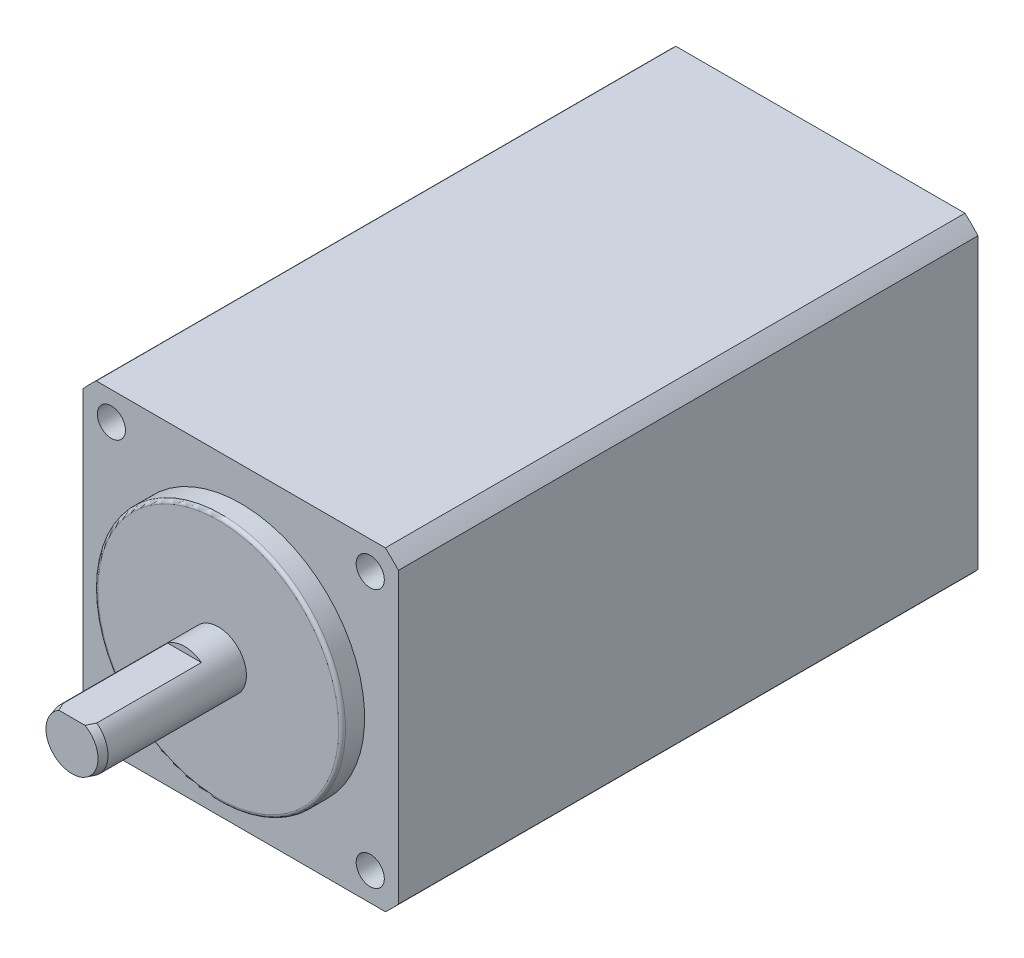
ISO-10303-21;
HEADER;
FILE_DESCRIPTION(('STEP AP214'),'2;1');
FILE_NAME('part.step','',(''),(''),'','','');
FILE_SCHEMA(('AUTOMOTIVE_DESIGN { 1 0 10303 214 1 1 1 1 }'));
ENDSEC;
DATA;
#1=APPLICATION_CONTEXT('core data for automotive mechanical design processes');
#2=APPLICATION_PROTOCOL_DEFINITION('international standard','automotive_design',2000,#1);
#3=PRODUCT_CONTEXT('',#1,'mechanical');
#4=PRODUCT('Part','Part','',(#3));
#5=PRODUCT_RELATED_PRODUCT_CATEGORY('part','',(#4));
#6=PRODUCT_DEFINITION_FORMATION('','',#4);
#7=PRODUCT_DEFINITION_CONTEXT('part definition',#1,'design');
#8=PRODUCT_DEFINITION('design','',#6,#7);
#9=PRODUCT_DEFINITION_SHAPE('','',#8);
#10=(LENGTH_UNIT() NAMED_UNIT(*) SI_UNIT(.MILLI.,.METRE.));
#11=(NAMED_UNIT(*) PLANE_ANGLE_UNIT() SI_UNIT($,.RADIAN.));
#12=(NAMED_UNIT(*) SI_UNIT($,.STERADIAN.) SOLID_ANGLE_UNIT());
#13=UNCERTAINTY_MEASURE_WITH_UNIT(LENGTH_MEASURE(1.E-05),#10,'distance_accuracy_value','');
#14=(GEOMETRIC_REPRESENTATION_CONTEXT(3) GLOBAL_UNCERTAINTY_ASSIGNED_CONTEXT((#13)) GLOBAL_UNIT_ASSIGNED_CONTEXT((#10,
#11,#12)) REPRESENTATION_CONTEXT('',''));
#15=CARTESIAN_POINT('',(0.,0.,0.));
#16=DIRECTION('',(0.,0.,1.));
#17=DIRECTION('',(1.,0.,0.));
#18=AXIS2_PLACEMENT_3D('',#15,#16,#17);
#19=CARTESIAN_POINT('',(-14.,0.,-51.5));
#20=DIRECTION('',(1.,0.,0.));
#21=DIRECTION('',(0.,0.,-1.));
#22=AXIS2_PLACEMENT_3D('',#19,#20,#21);
#23=PLANE('',#22);
#24=DIRECTION('',(0.,1.,0.));
#25=VECTOR('',#24,1.);
#26=CARTESIAN_POINT('',(-14.,0.,0.));
#27=LINE('',#26,#25);
#28=CARTESIAN_POINT('',(-14.,-12.8452325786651,0.));
#29=VERTEX_POINT('',#28);
#30=CARTESIAN_POINT('',(-14.,12.8452325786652,0.));
#31=VERTEX_POINT('',#30);
#32=EDGE_CURVE('E162',#29,#31,#27,.T.);
#33=ORIENTED_EDGE('',*,*,#32,.T.);
#34=DIRECTION('',(0.,0.,1.));
#35=VECTOR('',#34,1.);
#36=CARTESIAN_POINT('',(-14.,12.8452325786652,-51.5));
#37=LINE('',#36,#35);
#38=CARTESIAN_POINT('',(-14.,12.8452325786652,-51.5));
#39=VERTEX_POINT('',#38);
#40=EDGE_CURVE('E12',#39,#31,#37,.T.);
#41=ORIENTED_EDGE('',*,*,#40,.F.);
#42=DIRECTION('',(0.,1.,0.));
#43=VECTOR('',#42,1.);
#44=CARTESIAN_POINT('',(-14.,0.,-51.5));
#45=LINE('',#44,#43);
#46=CARTESIAN_POINT('',(-14.,-12.8452325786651,-51.5));
#47=VERTEX_POINT('',#46);
#48=EDGE_CURVE('E235',#47,#39,#45,.T.);
#49=ORIENTED_EDGE('',*,*,#48,.F.);
#50=DIRECTION('',(0.,0.,1.));
#51=VECTOR('',#50,1.);
#52=CARTESIAN_POINT('',(-14.,-12.8452325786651,-51.5));
#53=LINE('',#52,#51);
#54=EDGE_CURVE('E199',#47,#29,#53,.T.);
#55=ORIENTED_EDGE('',*,*,#54,.T.);
#56=EDGE_LOOP('',(#33,#41,#49,#55));
#57=FACE_BOUND('',#56,.T.);
#58=ADVANCED_FACE('F49',(#57),#23,.F.);
#59=CARTESIAN_POINT('',(0.,0.,-51.5));
#60=DIRECTION('',(0.,0.,1.));
#61=DIRECTION('',(1.,0.,0.));
#62=AXIS2_PLACEMENT_3D('',#59,#60,#61);
#63=CYLINDRICAL_SURFACE('',#62,19.);
#64=CARTESIAN_POINT('',(0.,0.,0.));
#65=DIRECTION('',(0.,0.,-1.));
#66=DIRECTION('',(-1.,0.,0.));
#67=AXIS2_PLACEMENT_3D('',#64,#65,#66);
#68=CIRCLE('',#67,19.);
#69=CARTESIAN_POINT('',(-12.8452325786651,14.,0.));
#70=VERTEX_POINT('',#69);
#71=EDGE_CURVE('E165',#31,#70,#68,.T.);
#72=ORIENTED_EDGE('',*,*,#71,.T.);
#73=DIRECTION('',(0.,0.,1.));
#74=VECTOR('',#73,1.);
#75=CARTESIAN_POINT('',(-12.8452325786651,14.,-51.5));
#76=LINE('',#75,#74);
#77=CARTESIAN_POINT('',(-12.8452325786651,14.,-51.5));
#78=VERTEX_POINT('',#77);
#79=EDGE_CURVE('E58',#78,#70,#76,.T.);
#80=ORIENTED_EDGE('',*,*,#79,.F.);
#81=CARTESIAN_POINT('',(0.,0.,-51.5));
#82=DIRECTION('',(0.,0.,-1.));
#83=DIRECTION('',(-1.,0.,0.));
#84=AXIS2_PLACEMENT_3D('',#81,#82,#83);
#85=CIRCLE('',#84,19.);
#86=EDGE_CURVE('E239',#39,#78,#85,.T.);
#87=ORIENTED_EDGE('',*,*,#86,.F.);
#88=ORIENTED_EDGE('',*,*,#40,.T.);
#89=EDGE_LOOP('',(#72,#80,#87,#88));
#90=FACE_BOUND('',#89,.T.);
#91=ADVANCED_FACE('F257',(#90),#63,.T.);
#92=CARTESIAN_POINT('',(0.,14.,-51.5));
#93=DIRECTION('',(0.,-1.,0.));
#94=DIRECTION('',(0.,0.,-1.));
#95=AXIS2_PLACEMENT_3D('',#92,#93,#94);
#96=PLANE('',#95);
#97=DIRECTION('',(1.,0.,0.));
#98=VECTOR('',#97,1.);
#99=CARTESIAN_POINT('',(0.,14.,0.));
#100=LINE('',#99,#98);
#101=CARTESIAN_POINT('',(12.8452325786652,14.,0.));
#102=VERTEX_POINT('',#101);
#103=EDGE_CURVE('E188',#70,#102,#100,.T.);
#104=ORIENTED_EDGE('',*,*,#103,.T.);
#105=DIRECTION('',(0.,0.,1.));
#106=VECTOR('',#105,1.);
#107=CARTESIAN_POINT('',(12.8452325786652,14.,-51.5));
#108=LINE('',#107,#106);
#109=CARTESIAN_POINT('',(12.8452325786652,14.,-51.5));
#110=VERTEX_POINT('',#109);
#111=EDGE_CURVE('E211',#110,#102,#108,.T.);
#112=ORIENTED_EDGE('',*,*,#111,.F.);
#113=DIRECTION('',(1.,0.,0.));
#114=VECTOR('',#113,1.);
#115=CARTESIAN_POINT('',(0.,14.,-51.5));
#116=LINE('',#115,#114);
#117=EDGE_CURVE('E221',#78,#110,#116,.T.);
#118=ORIENTED_EDGE('',*,*,#117,.F.);
#119=ORIENTED_EDGE('',*,*,#79,.T.);
#120=EDGE_LOOP('',(#104,#112,#118,#119));
#121=FACE_BOUND('',#120,.T.);
#122=ADVANCED_FACE('F219',(#121),#96,.F.);
#123=CARTESIAN_POINT('',(14.,12.8452325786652,0.));
#124=VERTEX_POINT('',#123);
#125=EDGE_CURVE('E190',#102,#124,#68,.T.);
#126=ORIENTED_EDGE('',*,*,#125,.T.);
#127=DIRECTION('',(0.,0.,1.));
#128=VECTOR('',#127,1.);
#129=CARTESIAN_POINT('',(14.,12.8452325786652,-51.5));
#130=LINE('',#129,#128);
#131=CARTESIAN_POINT('',(14.,12.8452325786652,-51.5));
#132=VERTEX_POINT('',#131);
#133=EDGE_CURVE('E209',#132,#124,#130,.T.);
#134=ORIENTED_EDGE('',*,*,#133,.F.);
#135=EDGE_CURVE('E244',#110,#132,#85,.T.);
#136=ORIENTED_EDGE('',*,*,#135,.F.);
#137=ORIENTED_EDGE('',*,*,#111,.T.);
#138=EDGE_LOOP('',(#126,#134,#136,#137));
#139=FACE_BOUND('',#138,.T.);
#140=ADVANCED_FACE('F260',(#139),#63,.T.);
#141=CARTESIAN_POINT('',(14.,0.,-51.5));
#142=DIRECTION('',(1.,0.,0.));
#143=DIRECTION('',(0.,0.,-1.));
#144=AXIS2_PLACEMENT_3D('',#141,#142,#143);
#145=PLANE('',#144);
#146=DIRECTION('',(0.,1.,0.));
#147=VECTOR('',#146,1.);
#148=CARTESIAN_POINT('',(14.,0.,0.));
#149=LINE('',#148,#147);
#150=CARTESIAN_POINT('',(14.,-12.8452325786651,0.));
#151=VERTEX_POINT('',#150);
#152=EDGE_CURVE('E192',#151,#124,#149,.T.);
#153=ORIENTED_EDGE('',*,*,#152,.F.);
#154=DIRECTION('',(0.,0.,1.));
#155=VECTOR('',#154,1.);
#156=CARTESIAN_POINT('',(14.,-12.8452325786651,-51.5));
#157=LINE('',#156,#155);
#158=CARTESIAN_POINT('',(14.,-12.8452325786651,-51.5));
#159=VERTEX_POINT('',#158);
#160=EDGE_CURVE('E207',#159,#151,#157,.T.);
#161=ORIENTED_EDGE('',*,*,#160,.F.);
#162=DIRECTION('',(0.,1.,0.));
#163=VECTOR('',#162,1.);
#164=CARTESIAN_POINT('',(14.,0.,-51.5));
#165=LINE('',#164,#163);
#166=EDGE_CURVE('E183',#159,#132,#165,.T.);
#167=ORIENTED_EDGE('',*,*,#166,.T.);
#168=ORIENTED_EDGE('',*,*,#133,.T.);
#169=EDGE_LOOP('',(#153,#161,#167,#168));
#170=FACE_BOUND('',#169,.T.);
#171=ADVANCED_FACE('F268',(#170),#145,.T.);
#172=CARTESIAN_POINT('',(12.8452325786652,-14.,0.));
#173=VERTEX_POINT('',#172);
#174=EDGE_CURVE('E195',#151,#173,#68,.T.);
#175=ORIENTED_EDGE('',*,*,#174,.T.);
#176=DIRECTION('',(0.,0.,1.));
#177=VECTOR('',#176,1.);
#178=CARTESIAN_POINT('',(12.8452325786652,-14.,-51.5));
#179=LINE('',#178,#177);
#180=CARTESIAN_POINT('',(12.8452325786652,-14.,-51.5));
#181=VERTEX_POINT('',#180);
#182=EDGE_CURVE('E205',#181,#173,#179,.T.);
#183=ORIENTED_EDGE('',*,*,#182,.F.);
#184=EDGE_CURVE('E180',#159,#181,#85,.T.);
#185=ORIENTED_EDGE('',*,*,#184,.F.);
#186=ORIENTED_EDGE('',*,*,#160,.T.);
#187=EDGE_LOOP('',(#175,#183,#185,#186));
#188=FACE_BOUND('',#187,.T.);
#189=ADVANCED_FACE('F269',(#188),#63,.T.);
#190=CARTESIAN_POINT('',(0.,-14.,-51.5));
#191=DIRECTION('',(0.,-1.,0.));
#192=DIRECTION('',(0.,0.,-1.));
#193=AXIS2_PLACEMENT_3D('',#190,#191,#192);
#194=PLANE('',#193);
#195=DIRECTION('',(0.,0.,-1.));
#196=VECTOR('',#195,1.);
#197=CARTESIAN_POINT('',(-7.6,-14.,-51.5));
#198=LINE('',#197,#196);
#199=CARTESIAN_POINT('',(-7.6,-14.,-42.));
#200=VERTEX_POINT('',#199);
#201=CARTESIAN_POINT('',(-7.6,-14.,-51.5));
#202=VERTEX_POINT('',#201);
#203=EDGE_CURVE('E52',#200,#202,#198,.T.);
#204=ORIENTED_EDGE('',*,*,#203,.F.);
#205=DIRECTION('',(-1.,0.,0.));
#206=VECTOR('',#205,1.);
#207=CARTESIAN_POINT('',(-7.6,-14.,-42.));
#208=LINE('',#207,#206);
#209=CARTESIAN_POINT('',(7.6,-14.,-42.));
#210=VERTEX_POINT('',#209);
#211=EDGE_CURVE('E159',#210,#200,#208,.T.);
#212=ORIENTED_EDGE('',*,*,#211,.F.);
#213=DIRECTION('',(0.,0.,1.));
#214=VECTOR('',#213,1.);
#215=CARTESIAN_POINT('',(7.6,-14.,-51.5));
#216=LINE('',#215,#214);
#217=CARTESIAN_POINT('',(7.6,-14.,-51.5));
#218=VERTEX_POINT('',#217);
#219=EDGE_CURVE('E71',#218,#210,#216,.T.);
#220=ORIENTED_EDGE('',*,*,#219,.F.);
#221=DIRECTION('',(1.,0.,0.));
#222=VECTOR('',#221,1.);
#223=CARTESIAN_POINT('',(0.,-14.,-51.5));
#224=LINE('',#223,#222);
#225=EDGE_CURVE('E176',#218,#181,#224,.T.);
#226=ORIENTED_EDGE('',*,*,#225,.T.);
#227=ORIENTED_EDGE('',*,*,#182,.T.);
#228=DIRECTION('',(1.,0.,0.));
#229=VECTOR('',#228,1.);
#230=CARTESIAN_POINT('',(0.,-14.,0.));
#231=LINE('',#230,#229);
#232=CARTESIAN_POINT('',(-12.8452325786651,-14.,0.));
#233=VERTEX_POINT('',#232);
#234=EDGE_CURVE('E196',#233,#173,#231,.T.);
#235=ORIENTED_EDGE('',*,*,#234,.F.);
#236=DIRECTION('',(0.,0.,1.));
#237=VECTOR('',#236,1.);
#238=CARTESIAN_POINT('',(-12.8452325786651,-14.,-51.5));
#239=LINE('',#238,#237);
#240=CARTESIAN_POINT('',(-12.8452325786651,-14.,-51.5));
#241=VERTEX_POINT('',#240);
#242=EDGE_CURVE('E202',#241,#233,#239,.T.);
#243=ORIENTED_EDGE('',*,*,#242,.F.);
#244=EDGE_CURVE('E179',#241,#202,#224,.T.);
#245=ORIENTED_EDGE('',*,*,#244,.T.);
#246=EDGE_LOOP('',(#204,#212,#220,#226,#227,#235,#243,#245));
#247=FACE_BOUND('',#246,.T.);
#248=ADVANCED_FACE('F253',(#247),#194,.T.);
#249=EDGE_CURVE('E189',#233,#29,#68,.T.);
#250=ORIENTED_EDGE('',*,*,#249,.T.);
#251=ORIENTED_EDGE('',*,*,#54,.F.);
#252=EDGE_CURVE('E203',#241,#47,#85,.T.);
#253=ORIENTED_EDGE('',*,*,#252,.F.);
#254=ORIENTED_EDGE('',*,*,#242,.T.);
#255=EDGE_LOOP('',(#250,#251,#253,#254));
#256=FACE_BOUND('',#255,.T.);
#257=ADVANCED_FACE('F255',(#256),#63,.T.);
#258=CARTESIAN_POINT('',(0.,0.,-51.5));
#259=DIRECTION('',(0.,0.,-1.));
#260=DIRECTION('',(-1.,0.,0.));
#261=AXIS2_PLACEMENT_3D('',#258,#259,#260);
#262=PLANE('',#261);
#263=ORIENTED_EDGE('',*,*,#48,.T.);
#264=ORIENTED_EDGE('',*,*,#86,.T.);
#265=ORIENTED_EDGE('',*,*,#117,.T.);
#266=ORIENTED_EDGE('',*,*,#135,.T.);
#267=ORIENTED_EDGE('',*,*,#166,.F.);
#268=ORIENTED_EDGE('',*,*,#184,.T.);
#269=ORIENTED_EDGE('',*,*,#225,.F.);
#270=DIRECTION('',(0.,1.,0.));
#271=VECTOR('',#270,1.);
#272=CARTESIAN_POINT('',(7.6,-19.,-51.5));
#273=LINE('',#272,#271);
#274=CARTESIAN_POINT('',(7.6,-19.,-51.5));
#275=VERTEX_POINT('',#274);
#276=EDGE_CURVE('E146',#275,#218,#273,.T.);
#277=ORIENTED_EDGE('',*,*,#276,.F.);
#278=DIRECTION('',(1.,0.,0.));
#279=VECTOR('',#278,1.);
#280=CARTESIAN_POINT('',(-7.6,-19.,-51.5));
#281=LINE('',#280,#279);
#282=CARTESIAN_POINT('',(-7.6,-19.,-51.5));
#283=VERTEX_POINT('',#282);
#284=EDGE_CURVE('E138',#283,#275,#281,.T.);
#285=ORIENTED_EDGE('',*,*,#284,.F.);
#286=DIRECTION('',(0.,1.,0.));
#287=VECTOR('',#286,1.);
#288=CARTESIAN_POINT('',(-7.6,-19.,-51.5));
#289=LINE('',#288,#287);
#290=EDGE_CURVE('E144',#283,#202,#289,.T.);
#291=ORIENTED_EDGE('',*,*,#290,.T.);
#292=ORIENTED_EDGE('',*,*,#244,.F.);
#293=ORIENTED_EDGE('',*,*,#252,.T.);
#294=EDGE_LOOP('',(#263,#264,#265,#266,#267,#268,#269,#277,#285,#291,#292,#293));
#295=FACE_BOUND('',#294,.T.);
#296=ADVANCED_FACE('F141',(#295),#262,.T.);
#297=CARTESIAN_POINT('',(0.,0.,0.));
#298=DIRECTION('',(0.,0.,-1.));
#299=DIRECTION('',(-1.,0.,0.));
#300=AXIS2_PLACEMENT_3D('',#297,#298,#299);
#301=PLANE('',#300);
#302=CARTESIAN_POINT('',(11.5,-11.5,0.));
#303=DIRECTION('',(0.,0.,1.));
#304=DIRECTION('',(1.,0.,0.));
#305=AXIS2_PLACEMENT_3D('',#302,#303,#304);
#306=CIRCLE('',#305,1.25);
#307=CARTESIAN_POINT('',(12.75,-11.5,0.));
#308=VERTEX_POINT('',#307);
#309=EDGE_CURVE('E314',#308,#308,#306,.T.);
#310=ORIENTED_EDGE('',*,*,#309,.F.);
#311=EDGE_LOOP('',(#310));
#312=FACE_BOUND('',#311,.T.);
#313=CARTESIAN_POINT('',(-11.5,-11.5,0.));
#314=DIRECTION('',(0.,0.,1.));
#315=DIRECTION('',(1.,0.,0.));
#316=AXIS2_PLACEMENT_3D('',#313,#314,#315);
#317=CIRCLE('',#316,1.25);
#318=CARTESIAN_POINT('',(-10.25,-11.5,0.));
#319=VERTEX_POINT('',#318);
#320=EDGE_CURVE('E318',#319,#319,#317,.T.);
#321=ORIENTED_EDGE('',*,*,#320,.F.);
#322=EDGE_LOOP('',(#321));
#323=FACE_BOUND('',#322,.T.);
#324=CARTESIAN_POINT('',(11.5,11.5,0.));
#325=DIRECTION('',(0.,0.,1.));
#326=DIRECTION('',(1.,0.,0.));
#327=AXIS2_PLACEMENT_3D('',#324,#325,#326);
#328=CIRCLE('',#327,1.25);
#329=CARTESIAN_POINT('',(12.75,11.5,0.));
#330=VERTEX_POINT('',#329);
#331=EDGE_CURVE('E322',#330,#330,#328,.T.);
#332=ORIENTED_EDGE('',*,*,#331,.F.);
#333=EDGE_LOOP('',(#332));
#334=FACE_BOUND('',#333,.T.);
#335=CARTESIAN_POINT('',(-11.5,11.5,0.));
#336=DIRECTION('',(0.,0.,1.));
#337=DIRECTION('',(1.,0.,0.));
#338=AXIS2_PLACEMENT_3D('',#335,#336,#337);
#339=CIRCLE('',#338,1.25);
#340=CARTESIAN_POINT('',(-10.25,11.5,0.));
#341=VERTEX_POINT('',#340);
#342=EDGE_CURVE('E325',#341,#341,#339,.T.);
#343=ORIENTED_EDGE('',*,*,#342,.F.);
#344=EDGE_LOOP('',(#343));
#345=FACE_BOUND('',#344,.T.);
#346=ORIENTED_EDGE('',*,*,#32,.F.);
#347=ORIENTED_EDGE('',*,*,#249,.F.);
#348=ORIENTED_EDGE('',*,*,#234,.T.);
#349=ORIENTED_EDGE('',*,*,#174,.F.);
#350=ORIENTED_EDGE('',*,*,#152,.T.);
#351=ORIENTED_EDGE('',*,*,#125,.F.);
#352=ORIENTED_EDGE('',*,*,#103,.F.);
#353=ORIENTED_EDGE('',*,*,#71,.F.);
#354=EDGE_LOOP('',(#346,#347,#348,#349,#350,#351,#352,#353));
#355=FACE_BOUND('',#354,.T.);
#356=ADVANCED_FACE('F226',(#312,#323,#334,#345,#355),#301,.F.);
#357=CARTESIAN_POINT('',(-7.6,-19.,-51.5));
#358=DIRECTION('',(1.,0.,0.));
#359=DIRECTION('',(0.,0.,-1.));
#360=AXIS2_PLACEMENT_3D('',#357,#358,#359);
#361=PLANE('',#360);
#362=ORIENTED_EDGE('',*,*,#203,.T.);
#363=ORIENTED_EDGE('',*,*,#290,.F.);
#364=DIRECTION('',(0.,0.,-1.));
#365=VECTOR('',#364,1.);
#366=CARTESIAN_POINT('',(-7.6,-19.,-51.5));
#367=LINE('',#366,#365);
#368=CARTESIAN_POINT('',(-7.6,-19.,-42.));
#369=VERTEX_POINT('',#368);
#370=EDGE_CURVE('E150',#369,#283,#367,.T.);
#371=ORIENTED_EDGE('',*,*,#370,.F.);
#372=DIRECTION('',(0.,1.,0.));
#373=VECTOR('',#372,1.);
#374=CARTESIAN_POINT('',(-7.6,-19.,-42.));
#375=LINE('',#374,#373);
#376=EDGE_CURVE('E289',#369,#200,#375,.T.);
#377=ORIENTED_EDGE('',*,*,#376,.T.);
#378=EDGE_LOOP('',(#362,#363,#371,#377));
#379=FACE_BOUND('',#378,.T.);
#380=ADVANCED_FACE('F161',(#379),#361,.F.);
#381=CARTESIAN_POINT('',(7.6,-19.,-51.5));
#382=DIRECTION('',(-1.,0.,0.));
#383=DIRECTION('',(0.,0.,1.));
#384=AXIS2_PLACEMENT_3D('',#381,#382,#383);
#385=PLANE('',#384);
#386=ORIENTED_EDGE('',*,*,#219,.T.);
#387=DIRECTION('',(0.,1.,0.));
#388=VECTOR('',#387,1.);
#389=CARTESIAN_POINT('',(7.6,-19.,-42.));
#390=LINE('',#389,#388);
#391=CARTESIAN_POINT('',(7.6,-19.,-42.));
#392=VERTEX_POINT('',#391);
#393=EDGE_CURVE('E167',#392,#210,#390,.T.);
#394=ORIENTED_EDGE('',*,*,#393,.F.);
#395=DIRECTION('',(0.,0.,1.));
#396=VECTOR('',#395,1.);
#397=CARTESIAN_POINT('',(7.6,-19.,-51.5));
#398=LINE('',#397,#396);
#399=EDGE_CURVE('E149',#275,#392,#398,.T.);
#400=ORIENTED_EDGE('',*,*,#399,.F.);
#401=ORIENTED_EDGE('',*,*,#276,.T.);
#402=EDGE_LOOP('',(#386,#394,#400,#401));
#403=FACE_BOUND('',#402,.T.);
#404=ADVANCED_FACE('F285',(#403),#385,.F.);
#405=CARTESIAN_POINT('',(-7.6,-19.,-42.));
#406=DIRECTION('',(0.,0.,-1.));
#407=DIRECTION('',(-1.,0.,0.));
#408=AXIS2_PLACEMENT_3D('',#405,#406,#407);
#409=PLANE('',#408);
#410=ORIENTED_EDGE('',*,*,#211,.T.);
#411=ORIENTED_EDGE('',*,*,#376,.F.);
#412=DIRECTION('',(-1.,0.,0.));
#413=VECTOR('',#412,1.);
#414=CARTESIAN_POINT('',(-7.6,-19.,-42.));
#415=LINE('',#414,#413);
#416=EDGE_CURVE('E155',#392,#369,#415,.T.);
#417=ORIENTED_EDGE('',*,*,#416,.F.);
#418=ORIENTED_EDGE('',*,*,#393,.T.);
#419=EDGE_LOOP('',(#410,#411,#417,#418));
#420=FACE_BOUND('',#419,.T.);
#421=ADVANCED_FACE('F294',(#420),#409,.F.);
#422=CARTESIAN_POINT('',(0.,-19.,0.));
#423=DIRECTION('',(0.,1.,0.));
#424=DIRECTION('',(0.,0.,1.));
#425=AXIS2_PLACEMENT_3D('',#422,#423,#424);
#426=PLANE('',#425);
#427=ORIENTED_EDGE('',*,*,#370,.T.);
#428=ORIENTED_EDGE('',*,*,#284,.T.);
#429=ORIENTED_EDGE('',*,*,#399,.T.);
#430=ORIENTED_EDGE('',*,*,#416,.T.);
#431=EDGE_LOOP('',(#427,#428,#429,#430));
#432=FACE_BOUND('',#431,.T.);
#433=ADVANCED_FACE('F153',(#432),#426,.F.);
#434=CARTESIAN_POINT('',(-11.5,11.5,-4.5));
#435=DIRECTION('',(0.,0.,1.));
#436=DIRECTION('',(1.,0.,0.));
#437=AXIS2_PLACEMENT_3D('',#434,#435,#436);
#438=CYLINDRICAL_SURFACE('',#437,1.25);
#439=CARTESIAN_POINT('',(-11.5,11.5,-4.5));
#440=DIRECTION('',(0.,0.,1.));
#441=DIRECTION('',(1.,0.,0.));
#442=AXIS2_PLACEMENT_3D('',#439,#440,#441);
#443=CIRCLE('',#442,1.25);
#444=CARTESIAN_POINT('',(-10.25,11.5,-4.5));
#445=VERTEX_POINT('',#444);
#446=EDGE_CURVE('E327',#445,#445,#443,.T.);
#447=ORIENTED_EDGE('',*,*,#446,.F.);
#448=EDGE_LOOP('',(#447));
#449=FACE_BOUND('',#448,.T.);
#450=ORIENTED_EDGE('',*,*,#342,.T.);
#451=EDGE_LOOP('',(#450));
#452=FACE_BOUND('',#451,.T.);
#453=ADVANCED_FACE('F301',(#449,#452),#438,.F.);
#454=CARTESIAN_POINT('',(-11.5,11.5,-4.5));
#455=DIRECTION('',(0.,0.,1.));
#456=DIRECTION('',(1.,0.,0.));
#457=AXIS2_PLACEMENT_3D('',#454,#455,#456);
#458=PLANE('',#457);
#459=ORIENTED_EDGE('',*,*,#446,.T.);
#460=EDGE_LOOP('',(#459));
#461=FACE_BOUND('',#460,.T.);
#462=ADVANCED_FACE('F371',(#461),#458,.T.);
#463=CARTESIAN_POINT('',(11.5,11.5,-4.5));
#464=DIRECTION('',(0.,0.,1.));
#465=DIRECTION('',(1.,0.,0.));
#466=AXIS2_PLACEMENT_3D('',#463,#464,#465);
#467=CYLINDRICAL_SURFACE('',#466,1.25);
#468=CARTESIAN_POINT('',(11.5,11.5,-4.5));
#469=DIRECTION('',(0.,0.,1.));
#470=DIRECTION('',(1.,0.,0.));
#471=AXIS2_PLACEMENT_3D('',#468,#469,#470);
#472=CIRCLE('',#471,1.25);
#473=CARTESIAN_POINT('',(12.75,11.5,-4.5));
#474=VERTEX_POINT('',#473);
#475=EDGE_CURVE('E328',#474,#474,#472,.T.);
#476=ORIENTED_EDGE('',*,*,#475,.F.);
#477=EDGE_LOOP('',(#476));
#478=FACE_BOUND('',#477,.T.);
#479=ORIENTED_EDGE('',*,*,#331,.T.);
#480=EDGE_LOOP('',(#479));
#481=FACE_BOUND('',#480,.T.);
#482=ADVANCED_FACE('F367',(#478,#481),#467,.F.);
#483=CARTESIAN_POINT('',(11.5,11.5,-4.5));
#484=DIRECTION('',(0.,0.,1.));
#485=DIRECTION('',(1.,0.,0.));
#486=AXIS2_PLACEMENT_3D('',#483,#484,#485);
#487=PLANE('',#486);
#488=ORIENTED_EDGE('',*,*,#475,.T.);
#489=EDGE_LOOP('',(#488));
#490=FACE_BOUND('',#489,.T.);
#491=ADVANCED_FACE('F363',(#490),#487,.T.);
#492=CARTESIAN_POINT('',(-11.5,-11.5,-4.5));
#493=DIRECTION('',(0.,0.,1.));
#494=DIRECTION('',(1.,0.,0.));
#495=AXIS2_PLACEMENT_3D('',#492,#493,#494);
#496=CYLINDRICAL_SURFACE('',#495,1.25);
#497=CARTESIAN_POINT('',(-11.5,-11.5,-4.5));
#498=DIRECTION('',(0.,0.,1.));
#499=DIRECTION('',(1.,0.,0.));
#500=AXIS2_PLACEMENT_3D('',#497,#498,#499);
#501=CIRCLE('',#500,1.25);
#502=CARTESIAN_POINT('',(-10.25,-11.5,-4.5));
#503=VERTEX_POINT('',#502);
#504=EDGE_CURVE('E335',#503,#503,#501,.T.);
#505=ORIENTED_EDGE('',*,*,#504,.F.);
#506=EDGE_LOOP('',(#505));
#507=FACE_BOUND('',#506,.T.);
#508=ORIENTED_EDGE('',*,*,#320,.T.);
#509=EDGE_LOOP('',(#508));
#510=FACE_BOUND('',#509,.T.);
#511=ADVANCED_FACE('F357',(#507,#510),#496,.F.);
#512=CARTESIAN_POINT('',(-11.5,-11.5,-4.5));
#513=DIRECTION('',(0.,0.,1.));
#514=DIRECTION('',(1.,0.,0.));
#515=AXIS2_PLACEMENT_3D('',#512,#513,#514);
#516=PLANE('',#515);
#517=ORIENTED_EDGE('',*,*,#504,.T.);
#518=EDGE_LOOP('',(#517));
#519=FACE_BOUND('',#518,.T.);
#520=ADVANCED_FACE('F350',(#519),#516,.T.);
#521=CARTESIAN_POINT('',(11.5,-11.5,-4.5));
#522=DIRECTION('',(0.,0.,1.));
#523=DIRECTION('',(1.,0.,0.));
#524=AXIS2_PLACEMENT_3D('',#521,#522,#523);
#525=CYLINDRICAL_SURFACE('',#524,1.25);
#526=CARTESIAN_POINT('',(11.5,-11.5,-4.5));
#527=DIRECTION('',(0.,0.,1.));
#528=DIRECTION('',(1.,0.,0.));
#529=AXIS2_PLACEMENT_3D('',#526,#527,#528);
#530=CIRCLE('',#529,1.25);
#531=CARTESIAN_POINT('',(12.75,-11.5,-4.5));
#532=VERTEX_POINT('',#531);
#533=EDGE_CURVE('E338',#532,#532,#530,.T.);
#534=ORIENTED_EDGE('',*,*,#533,.F.);
#535=EDGE_LOOP('',(#534));
#536=FACE_BOUND('',#535,.T.);
#537=ORIENTED_EDGE('',*,*,#309,.T.);
#538=EDGE_LOOP('',(#537));
#539=FACE_BOUND('',#538,.T.);
#540=ADVANCED_FACE('F347',(#536,#539),#525,.F.);
#541=CARTESIAN_POINT('',(11.5,-11.5,-4.5));
#542=DIRECTION('',(0.,0.,1.));
#543=DIRECTION('',(1.,0.,0.));
#544=AXIS2_PLACEMENT_3D('',#541,#542,#543);
#545=PLANE('',#544);
#546=ORIENTED_EDGE('',*,*,#533,.T.);
#547=EDGE_LOOP('',(#546));
#548=FACE_BOUND('',#547,.T.);
#549=ADVANCED_FACE('F345',(#548),#545,.T.);
#550=CLOSED_SHELL('',(#58,#91,#122,#140,#171,#189,#248,#257,#296,#356,#380,#404,#421,#433,#453,
#462,#482,#491,#511,#520,#540,#549));
#551=MANIFOLD_SOLID_BREP('B2',#550);
#552=CARTESIAN_POINT('',(0.,0.,15.));
#553=DIRECTION('',(0.,0.,-1.));
#554=DIRECTION('',(-1.,0.,0.));
#555=AXIS2_PLACEMENT_3D('',#552,#553,#554);
#556=CYLINDRICAL_SURFACE('',#555,2.5);
#557=DIRECTION('',(0.,0.,-1.));
#558=VECTOR('',#557,1.);
#559=CARTESIAN_POINT('',(1.5,2.,15.));
#560=LINE('',#559,#558);
#561=CARTESIAN_POINT('',(1.5,2.,5.));
#562=VERTEX_POINT('',#561);
#563=CARTESIAN_POINT('',(1.5,2.,14.3));
#564=VERTEX_POINT('',#563);
#565=EDGE_CURVE('E546',#562,#564,#560,.F.);
#566=ORIENTED_EDGE('',*,*,#565,.T.);
#567=CARTESIAN_POINT('',(0.,0.,14.3));
#568=DIRECTION('',(0.,0.,1.));
#569=DIRECTION('',(1.,0.,0.));
#570=AXIS2_PLACEMENT_3D('',#567,#568,#569);
#571=CIRCLE('',#570,2.5);
#572=CARTESIAN_POINT('',(-1.5,2.,14.3));
#573=VERTEX_POINT('',#572);
#574=EDGE_CURVE('E521',#564,#573,#571,.F.);
#575=ORIENTED_EDGE('',*,*,#574,.T.);
#576=DIRECTION('',(0.,0.,-1.));
#577=VECTOR('',#576,1.);
#578=CARTESIAN_POINT('',(-1.5,2.,15.));
#579=LINE('',#578,#577);
#580=CARTESIAN_POINT('',(-1.5,2.,5.));
#581=VERTEX_POINT('',#580);
#582=EDGE_CURVE('E539',#573,#581,#579,.T.);
#583=ORIENTED_EDGE('',*,*,#582,.T.);
#584=CARTESIAN_POINT('',(0.,0.,5.));
#585=DIRECTION('',(0.,0.,1.));
#586=DIRECTION('',(1.,0.,0.));
#587=AXIS2_PLACEMENT_3D('',#584,#585,#586);
#588=CIRCLE('',#587,2.5);
#589=EDGE_CURVE('E542',#562,#581,#588,.T.);
#590=ORIENTED_EDGE('',*,*,#589,.F.);
#591=EDGE_LOOP('',(#566,#575,#583,#590));
#592=FACE_BOUND('',#591,.T.);
#593=CARTESIAN_POINT('',(0.,0.,2.));
#594=DIRECTION('',(0.,0.,-1.));
#595=DIRECTION('',(-1.,0.,0.));
#596=AXIS2_PLACEMENT_3D('',#593,#594,#595);
#597=CIRCLE('',#596,2.5);
#598=CARTESIAN_POINT('',(-2.5,0.,2.));
#599=VERTEX_POINT('',#598);
#600=EDGE_CURVE('E561',#599,#599,#597,.T.);
#601=ORIENTED_EDGE('',*,*,#600,.F.);
#602=EDGE_LOOP('',(#601));
#603=FACE_BOUND('',#602,.T.);
#604=ADVANCED_FACE('F506',(#592,#603),#556,.T.);
#605=CARTESIAN_POINT('',(0.,0.,15.));
#606=DIRECTION('',(0.,0.,1.));
#607=DIRECTION('',(1.,0.,0.));
#608=AXIS2_PLACEMENT_3D('',#605,#606,#607);
#609=PLANE('',#608);
#610=DIRECTION('',(1.,0.,0.));
#611=VECTOR('',#610,1.);
#612=CARTESIAN_POINT('',(0.,2.,15.));
#613=LINE('',#612,#611);
#614=CARTESIAN_POINT('',(-1.16075761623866,2.,15.));
#615=VERTEX_POINT('',#614);
#616=CARTESIAN_POINT('',(1.16075761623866,2.,15.));
#617=VERTEX_POINT('',#616);
#618=EDGE_CURVE('E553',#615,#617,#613,.T.);
#619=ORIENTED_EDGE('',*,*,#618,.F.);
#620=CARTESIAN_POINT('',(0.,0.,15.));
#621=DIRECTION('',(0.,0.,1.));
#622=DIRECTION('',(1.,0.,0.));
#623=AXIS2_PLACEMENT_3D('',#620,#621,#622);
#624=CIRCLE('',#623,2.31243556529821);
#625=EDGE_CURVE('E552',#615,#617,#624,.T.);
#626=ORIENTED_EDGE('',*,*,#625,.T.);
#627=EDGE_LOOP('',(#619,#626));
#628=FACE_BOUND('',#627,.T.);
#629=ADVANCED_FACE('F589',(#628),#609,.T.);
#630=CARTESIAN_POINT('',(0.,0.,2.));
#631=DIRECTION('',(0.,0.,-1.));
#632=DIRECTION('',(-1.,0.,0.));
#633=AXIS2_PLACEMENT_3D('',#630,#631,#632);
#634=PLANE('',#633);
#635=CARTESIAN_POINT('',(0.,0.,2.));
#636=DIRECTION('',(0.,0.,-1.));
#637=DIRECTION('',(-1.,0.,0.));
#638=AXIS2_PLACEMENT_3D('',#635,#636,#637);
#639=CIRCLE('',#638,10.7);
#640=CARTESIAN_POINT('',(-10.7,0.,2.));
#641=VERTEX_POINT('',#640);
#642=EDGE_CURVE('E47',#641,#641,#639,.F.);
#643=ORIENTED_EDGE('',*,*,#642,.T.);
#644=EDGE_LOOP('',(#643));
#645=FACE_BOUND('',#644,.T.);
#646=ORIENTED_EDGE('',*,*,#600,.T.);
#647=EDGE_LOOP('',(#646));
#648=FACE_BOUND('',#647,.T.);
#649=ADVANCED_FACE('F584',(#645,#648),#634,.F.);
#650=CARTESIAN_POINT('',(0.,0.,2.));
#651=DIRECTION('',(0.,0.,-1.));
#652=DIRECTION('',(-1.,0.,0.));
#653=AXIS2_PLACEMENT_3D('',#650,#651,#652);
#654=CYLINDRICAL_SURFACE('',#653,11.);
#655=CARTESIAN_POINT('',(0.,0.,1.7));
#656=DIRECTION('',(0.,0.,-1.));
#657=DIRECTION('',(-1.,0.,0.));
#658=AXIS2_PLACEMENT_3D('',#655,#656,#657);
#659=CIRCLE('',#658,11.);
#660=CARTESIAN_POINT('',(-11.,0.,1.7));
#661=VERTEX_POINT('',#660);
#662=EDGE_CURVE('E514',#661,#661,#659,.T.);
#663=ORIENTED_EDGE('',*,*,#662,.T.);
#664=EDGE_LOOP('',(#663));
#665=FACE_BOUND('',#664,.T.);
#666=CARTESIAN_POINT('',(0.,0.,0.));
#667=DIRECTION('',(0.,0.,-1.));
#668=DIRECTION('',(-1.,0.,0.));
#669=AXIS2_PLACEMENT_3D('',#666,#667,#668);
#670=CIRCLE('',#669,11.);
#671=CARTESIAN_POINT('',(-11.,0.,0.));
#672=VERTEX_POINT('',#671);
#673=EDGE_CURVE('E545',#672,#672,#670,.T.);
#674=ORIENTED_EDGE('',*,*,#673,.F.);
#675=EDGE_LOOP('',(#674));
#676=FACE_BOUND('',#675,.T.);
#677=ADVANCED_FACE('F588',(#665,#676),#654,.T.);
#678=CARTESIAN_POINT('',(0.,0.,0.));
#679=DIRECTION('',(0.,0.,1.));
#680=DIRECTION('',(1.,0.,0.));
#681=AXIS2_PLACEMENT_3D('',#678,#679,#680);
#682=PLANE('',#681);
#683=ORIENTED_EDGE('',*,*,#673,.T.);
#684=EDGE_LOOP('',(#683));
#685=FACE_BOUND('',#684,.T.);
#686=ADVANCED_FACE('F593',(#685),#682,.F.);
#687=CARTESIAN_POINT('',(0.,0.,5.));
#688=DIRECTION('',(0.,0.,1.));
#689=DIRECTION('',(1.,0.,0.));
#690=AXIS2_PLACEMENT_3D('',#687,#688,#689);
#691=PLANE('',#690);
#692=ORIENTED_EDGE('',*,*,#589,.T.);
#693=DIRECTION('',(1.,0.,0.));
#694=VECTOR('',#693,1.);
#695=CARTESIAN_POINT('',(-2.53785492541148,2.,5.));
#696=LINE('',#695,#694);
#697=EDGE_CURVE('E551',#581,#562,#696,.T.);
#698=ORIENTED_EDGE('',*,*,#697,.T.);
#699=EDGE_LOOP('',(#692,#698));
#700=FACE_BOUND('',#699,.T.);
#701=ADVANCED_FACE('F550',(#700),#691,.T.);
#702=CARTESIAN_POINT('',(-2.53785492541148,2.,5.));
#703=DIRECTION('',(0.,-1.,0.));
#704=DIRECTION('',(0.,0.,-1.));
#705=AXIS2_PLACEMENT_3D('',#702,#703,#704);
#706=PLANE('',#705);
#707=ORIENTED_EDGE('',*,*,#618,.T.);
#708=CARTESIAN_POINT('',(1.16075761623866,2.,15.));
#709=CARTESIAN_POINT('',(1.19128641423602,2.,14.9427849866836));
#710=CARTESIAN_POINT('',(1.22113150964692,2.,14.8852109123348));
#711=CARTESIAN_POINT('',(1.27963273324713,2.,14.7694828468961));
#712=CARTESIAN_POINT('',(1.30828921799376,2.,14.711329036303));
#713=CARTESIAN_POINT('',(1.36460851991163,2.,14.5945478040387));
#714=CARTESIAN_POINT('',(1.39227138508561,2.,14.535920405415));
#715=CARTESIAN_POINT('',(1.44674461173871,2.,14.4182490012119));
#716=CARTESIAN_POINT('',(1.47355471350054,2.,14.3592048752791));
#717=CARTESIAN_POINT('',(1.5,2.,14.3));
#718=B_SPLINE_CURVE_WITH_KNOTS('',3,(#708,#709,#710,#711,#712,#713,#714,#715,#716,#717),
.UNSPECIFIED.,.F.,.F.,(4,2,2,2,4),(0.,0.194539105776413,0.389019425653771,0.583490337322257,
0.778019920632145),.UNSPECIFIED.);
#719=EDGE_CURVE('E529',#617,#564,#718,.T.);
#720=ORIENTED_EDGE('',*,*,#719,.T.);
#721=ORIENTED_EDGE('',*,*,#565,.F.);
#722=ORIENTED_EDGE('',*,*,#697,.F.);
#723=ORIENTED_EDGE('',*,*,#582,.F.);
#724=CARTESIAN_POINT('',(-1.5,2.,14.3));
#725=CARTESIAN_POINT('',(-1.47355471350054,2.,14.3592048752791));
#726=CARTESIAN_POINT('',(-1.44674461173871,2.,14.4182490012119));
#727=CARTESIAN_POINT('',(-1.39227138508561,2.,14.535920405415));
#728=CARTESIAN_POINT('',(-1.36460851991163,2.,14.5945478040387));
#729=CARTESIAN_POINT('',(-1.30828921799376,2.,14.711329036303));
#730=CARTESIAN_POINT('',(-1.27963273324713,2.,14.7694828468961));
#731=CARTESIAN_POINT('',(-1.22113150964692,2.,14.8852109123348));
#732=CARTESIAN_POINT('',(-1.19128641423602,2.,14.9427849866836));
#733=CARTESIAN_POINT('',(-1.16075761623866,2.,15.));
#734=B_SPLINE_CURVE_WITH_KNOTS('',3,(#724,#725,#726,#727,#728,#729,#730,#731,#732,#733),
.UNSPECIFIED.,.F.,.F.,(4,2,2,2,4),(0.,0.194529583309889,0.389000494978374,0.583480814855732,
0.778019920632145),.UNSPECIFIED.);
#735=EDGE_CURVE('E567',#573,#615,#734,.T.);
#736=ORIENTED_EDGE('',*,*,#735,.T.);
#737=EDGE_LOOP('',(#707,#720,#721,#722,#723,#736));
#738=FACE_BOUND('',#737,.T.);
#739=ADVANCED_FACE('F555',(#738),#706,.F.);
#740=CARTESIAN_POINT('',(0.,0.,15.));
#741=DIRECTION('',(0.,0.,-1.));
#742=DIRECTION('',(-1.,0.,0.));
#743=AXIS2_PLACEMENT_3D('',#740,#741,#742);
#744=CONICAL_SURFACE('',#743,2.31243556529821,0.261799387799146);
#745=ORIENTED_EDGE('',*,*,#735,.F.);
#746=ORIENTED_EDGE('',*,*,#574,.F.);
#747=ORIENTED_EDGE('',*,*,#719,.F.);
#748=ORIENTED_EDGE('',*,*,#625,.F.);
#749=EDGE_LOOP('',(#745,#746,#747,#748));
#750=FACE_BOUND('',#749,.T.);
#751=ADVANCED_FACE('F577',(#750),#744,.T.);
#752=CARTESIAN_POINT('',(0.,0.,1.7));
#753=DIRECTION('',(0.,0.,-1.));
#754=DIRECTION('',(-1.,0.,0.));
#755=AXIS2_PLACEMENT_3D('',#752,#753,#754);
#756=TOROIDAL_SURFACE('',#755,10.7,0.3);
#757=ORIENTED_EDGE('',*,*,#642,.F.);
#758=EDGE_LOOP('',(#757));
#759=FACE_BOUND('',#758,.T.);
#760=ORIENTED_EDGE('',*,*,#662,.F.);
#761=EDGE_LOOP('',(#760));
#762=FACE_BOUND('',#761,.T.);
#763=ADVANCED_FACE('F508',(#759,#762),#756,.T.);
#764=CLOSED_SHELL('',(#604,#629,#649,#677,#686,#701,#739,#751,#763));
#765=MANIFOLD_SOLID_BREP('B6',#764);
#766=ADVANCED_BREP_SHAPE_REPRESENTATION('',(#18,#551,#765),#14);
#767=SHAPE_DEFINITION_REPRESENTATION(#9,#766);
ENDSEC;
END-ISO-10303-21;
